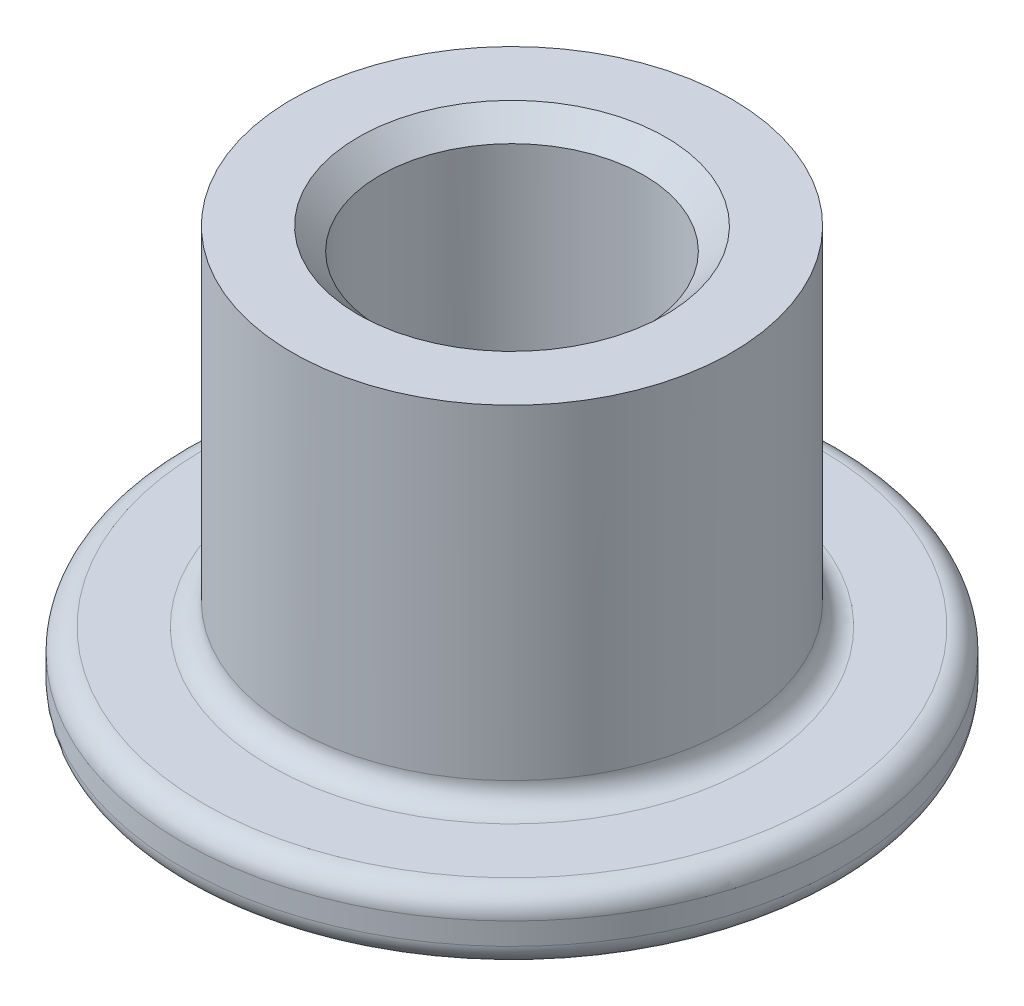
ISO-10303-21;
HEADER;
FILE_DESCRIPTION(('STEP AP214'),'2;1');
FILE_NAME('part.step','',(''),(''),'','','');
FILE_SCHEMA(('AUTOMOTIVE_DESIGN { 1 0 10303 214 1 1 1 1 }'));
ENDSEC;
DATA;
#1=APPLICATION_CONTEXT('core data for automotive mechanical design processes');
#2=APPLICATION_PROTOCOL_DEFINITION('international standard','automotive_design',2000,#1);
#3=PRODUCT_CONTEXT('',#1,'mechanical');
#4=PRODUCT('Part','Part','',(#3));
#5=PRODUCT_RELATED_PRODUCT_CATEGORY('part','',(#4));
#6=PRODUCT_DEFINITION_FORMATION('','',#4);
#7=PRODUCT_DEFINITION_CONTEXT('part definition',#1,'design');
#8=PRODUCT_DEFINITION('design','',#6,#7);
#9=PRODUCT_DEFINITION_SHAPE('','',#8);
#10=(LENGTH_UNIT() NAMED_UNIT(*) SI_UNIT(.MILLI.,.METRE.));
#11=(NAMED_UNIT(*) PLANE_ANGLE_UNIT() SI_UNIT($,.RADIAN.));
#12=(NAMED_UNIT(*) SI_UNIT($,.STERADIAN.) SOLID_ANGLE_UNIT());
#13=UNCERTAINTY_MEASURE_WITH_UNIT(LENGTH_MEASURE(1.E-05),#10,'distance_accuracy_value','');
#14=(GEOMETRIC_REPRESENTATION_CONTEXT(3) GLOBAL_UNCERTAINTY_ASSIGNED_CONTEXT((#13)) GLOBAL_UNIT_ASSIGNED_CONTEXT((#10,
#11,#12)) REPRESENTATION_CONTEXT('',''));
#15=CARTESIAN_POINT('',(0.,0.,0.));
#16=DIRECTION('',(0.,0.,1.));
#17=DIRECTION('',(1.,0.,0.));
#18=AXIS2_PLACEMENT_3D('',#15,#16,#17);
#19=CARTESIAN_POINT('',(0.,-18.2966101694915,0.));
#20=DIRECTION('',(0.,-1.,0.));
#21=DIRECTION('',(0.,0.,-1.));
#22=AXIS2_PLACEMENT_3D('',#19,#20,#21);
#23=CYLINDRICAL_SURFACE('',#22,3.);
#24=CARTESIAN_POINT('',(0.,0.5,0.));
#25=DIRECTION('',(0.,-1.,0.));
#26=DIRECTION('',(0.,0.,-1.));
#27=AXIS2_PLACEMENT_3D('',#24,#25,#26);
#28=CIRCLE('',#27,3.);
#29=CARTESIAN_POINT('',(0.,0.5,-3.));
#30=VERTEX_POINT('',#29);
#31=EDGE_CURVE('E61',#30,#30,#28,.T.);
#32=ORIENTED_EDGE('',*,*,#31,.T.);
#33=EDGE_LOOP('',(#32));
#34=FACE_BOUND('',#33,.T.);
#35=CARTESIAN_POINT('',(0.,8.9,0.));
#36=DIRECTION('',(0.,1.,0.));
#37=DIRECTION('',(0.,0.,1.));
#38=AXIS2_PLACEMENT_3D('',#35,#36,#37);
#39=CIRCLE('',#38,3.);
#40=CARTESIAN_POINT('',(0.,8.9,3.));
#41=VERTEX_POINT('',#40);
#42=EDGE_CURVE('E64',#41,#41,#39,.T.);
#43=ORIENTED_EDGE('',*,*,#42,.T.);
#44=EDGE_LOOP('',(#43));
#45=FACE_BOUND('',#44,.T.);
#46=ADVANCED_FACE('F29',(#34,#45),#23,.F.);
#47=CARTESIAN_POINT('',(3.,0.,0.));
#48=DIRECTION('',(0.,-1.,0.));
#49=DIRECTION('',(0.,0.,-1.));
#50=AXIS2_PLACEMENT_3D('',#47,#48,#49);
#51=PLANE('',#50);
#52=CARTESIAN_POINT('',(0.,0.,0.));
#53=DIRECTION('',(0.,-1.,0.));
#54=DIRECTION('',(0.,0.,-1.));
#55=AXIS2_PLACEMENT_3D('',#52,#53,#54);
#56=CIRCLE('',#55,7.);
#57=CARTESIAN_POINT('',(0.,0.,-7.));
#58=VERTEX_POINT('',#57);
#59=EDGE_CURVE('E40',#58,#58,#56,.T.);
#60=ORIENTED_EDGE('',*,*,#59,.T.);
#61=EDGE_LOOP('',(#60));
#62=FACE_BOUND('',#61,.T.);
#63=CARTESIAN_POINT('',(0.,0.,0.));
#64=DIRECTION('',(0.,-1.,0.));
#65=DIRECTION('',(0.,0.,-1.));
#66=AXIS2_PLACEMENT_3D('',#63,#64,#65);
#67=CIRCLE('',#66,3.5);
#68=CARTESIAN_POINT('',(0.,0.,-3.5));
#69=VERTEX_POINT('',#68);
#70=EDGE_CURVE('E58',#69,#69,#67,.F.);
#71=ORIENTED_EDGE('',*,*,#70,.T.);
#72=EDGE_LOOP('',(#71));
#73=FACE_BOUND('',#72,.T.);
#74=ADVANCED_FACE('F89',(#62,#73),#51,.T.);
#75=CARTESIAN_POINT('',(0.,-18.2966101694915,0.));
#76=DIRECTION('',(0.,-1.,0.));
#77=DIRECTION('',(0.,0.,-1.));
#78=AXIS2_PLACEMENT_3D('',#75,#76,#77);
#79=CYLINDRICAL_SURFACE('',#78,7.5);
#80=CARTESIAN_POINT('',(0.,0.5,0.));
#81=DIRECTION('',(0.,-1.,0.));
#82=DIRECTION('',(0.,0.,-1.));
#83=AXIS2_PLACEMENT_3D('',#80,#81,#82);
#84=CIRCLE('',#83,7.5);
#85=CARTESIAN_POINT('',(0.,0.5,-7.5));
#86=VERTEX_POINT('',#85);
#87=EDGE_CURVE('E10',#86,#86,#84,.F.);
#88=ORIENTED_EDGE('',*,*,#87,.T.);
#89=EDGE_LOOP('',(#88));
#90=FACE_BOUND('',#89,.T.);
#91=CARTESIAN_POINT('',(0.,1.,0.));
#92=DIRECTION('',(0.,1.,0.));
#93=DIRECTION('',(0.,0.,1.));
#94=AXIS2_PLACEMENT_3D('',#91,#92,#93);
#95=CIRCLE('',#94,7.5);
#96=CARTESIAN_POINT('',(0.,1.,7.5));
#97=VERTEX_POINT('',#96);
#98=EDGE_CURVE('E36',#97,#97,#95,.F.);
#99=ORIENTED_EDGE('',*,*,#98,.T.);
#100=EDGE_LOOP('',(#99));
#101=FACE_BOUND('',#100,.T.);
#102=ADVANCED_FACE('F95',(#90,#101),#79,.T.);
#103=CARTESIAN_POINT('',(7.5,1.5,0.));
#104=DIRECTION('',(0.,1.,0.));
#105=DIRECTION('',(0.,0.,1.));
#106=AXIS2_PLACEMENT_3D('',#103,#104,#105);
#107=PLANE('',#106);
#108=CARTESIAN_POINT('',(0.,1.5,0.));
#109=DIRECTION('',(0.,1.,0.));
#110=DIRECTION('',(0.,0.,1.));
#111=AXIS2_PLACEMENT_3D('',#108,#109,#110);
#112=CIRCLE('',#111,5.5);
#113=CARTESIAN_POINT('',(0.,1.5,5.5));
#114=VERTEX_POINT('',#113);
#115=EDGE_CURVE('E49',#114,#114,#112,.F.);
#116=ORIENTED_EDGE('',*,*,#115,.T.);
#117=EDGE_LOOP('',(#116));
#118=FACE_BOUND('',#117,.T.);
#119=CARTESIAN_POINT('',(0.,1.5,0.));
#120=DIRECTION('',(0.,1.,0.));
#121=DIRECTION('',(0.,0.,1.));
#122=AXIS2_PLACEMENT_3D('',#119,#120,#121);
#123=CIRCLE('',#122,7.);
#124=CARTESIAN_POINT('',(0.,1.5,7.));
#125=VERTEX_POINT('',#124);
#126=EDGE_CURVE('E52',#125,#125,#123,.T.);
#127=ORIENTED_EDGE('',*,*,#126,.T.);
#128=EDGE_LOOP('',(#127));
#129=FACE_BOUND('',#128,.T.);
#130=ADVANCED_FACE('F85',(#118,#129),#107,.T.);
#131=CARTESIAN_POINT('',(0.,-18.2966101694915,0.));
#132=DIRECTION('',(0.,-1.,0.));
#133=DIRECTION('',(0.,0.,-1.));
#134=AXIS2_PLACEMENT_3D('',#131,#132,#133);
#135=CYLINDRICAL_SURFACE('',#134,5.);
#136=CARTESIAN_POINT('',(0.,2.,0.));
#137=DIRECTION('',(0.,1.,0.));
#138=DIRECTION('',(0.,0.,1.));
#139=AXIS2_PLACEMENT_3D('',#136,#137,#138);
#140=CIRCLE('',#139,5.);
#141=CARTESIAN_POINT('',(0.,2.,5.));
#142=VERTEX_POINT('',#141);
#143=EDGE_CURVE('E44',#142,#142,#140,.T.);
#144=ORIENTED_EDGE('',*,*,#143,.T.);
#145=EDGE_LOOP('',(#144));
#146=FACE_BOUND('',#145,.T.);
#147=CARTESIAN_POINT('',(0.,9.4,0.));
#148=DIRECTION('',(0.,-1.,0.));
#149=DIRECTION('',(0.,0.,-1.));
#150=AXIS2_PLACEMENT_3D('',#147,#148,#149);
#151=CIRCLE('',#150,5.);
#152=CARTESIAN_POINT('',(0.,9.4,-5.));
#153=VERTEX_POINT('',#152);
#154=EDGE_CURVE('E67',#153,#153,#151,.T.);
#155=ORIENTED_EDGE('',*,*,#154,.T.);
#156=EDGE_LOOP('',(#155));
#157=FACE_BOUND('',#156,.T.);
#158=ADVANCED_FACE('F71',(#146,#157),#135,.T.);
#159=CARTESIAN_POINT('',(5.,9.4,0.));
#160=DIRECTION('',(0.,1.,0.));
#161=DIRECTION('',(0.,0.,1.));
#162=AXIS2_PLACEMENT_3D('',#159,#160,#161);
#163=PLANE('',#162);
#164=CARTESIAN_POINT('',(0.,9.4,0.));
#165=DIRECTION('',(0.,1.,0.));
#166=DIRECTION('',(0.,0.,1.));
#167=AXIS2_PLACEMENT_3D('',#164,#165,#166);
#168=CIRCLE('',#167,3.5);
#169=CARTESIAN_POINT('',(0.,9.4,3.5));
#170=VERTEX_POINT('',#169);
#171=EDGE_CURVE('E55',#170,#170,#168,.F.);
#172=ORIENTED_EDGE('',*,*,#171,.T.);
#173=EDGE_LOOP('',(#172));
#174=FACE_BOUND('',#173,.T.);
#175=ORIENTED_EDGE('',*,*,#154,.F.);
#176=EDGE_LOOP('',(#175));
#177=FACE_BOUND('',#176,.T.);
#178=ADVANCED_FACE('F73',(#174,#177),#163,.T.);
#179=CARTESIAN_POINT('',(0.,0.5,0.));
#180=DIRECTION('',(0.,-1.,0.));
#181=DIRECTION('',(0.,0.,-1.));
#182=AXIS2_PLACEMENT_3D('',#179,#180,#181);
#183=CONICAL_SURFACE('',#182,3.,0.78539816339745);
#184=ORIENTED_EDGE('',*,*,#70,.F.);
#185=EDGE_LOOP('',(#184));
#186=FACE_BOUND('',#185,.T.);
#187=ORIENTED_EDGE('',*,*,#31,.F.);
#188=EDGE_LOOP('',(#187));
#189=FACE_BOUND('',#188,.T.);
#190=ADVANCED_FACE('F75',(#186,#189),#183,.F.);
#191=CARTESIAN_POINT('',(0.,9.4,0.));
#192=DIRECTION('',(0.,1.,0.));
#193=DIRECTION('',(0.,0.,1.));
#194=AXIS2_PLACEMENT_3D('',#191,#192,#193);
#195=CONICAL_SURFACE('',#194,3.5,0.785398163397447);
#196=ORIENTED_EDGE('',*,*,#42,.F.);
#197=EDGE_LOOP('',(#196));
#198=FACE_BOUND('',#197,.T.);
#199=ORIENTED_EDGE('',*,*,#171,.F.);
#200=EDGE_LOOP('',(#199));
#201=FACE_BOUND('',#200,.T.);
#202=ADVANCED_FACE('F82',(#198,#201),#195,.F.);
#203=CARTESIAN_POINT('',(0.,2.,0.));
#204=DIRECTION('',(0.,1.,0.));
#205=DIRECTION('',(0.,0.,1.));
#206=AXIS2_PLACEMENT_3D('',#203,#204,#205);
#207=TOROIDAL_SURFACE('',#206,5.5,0.5);
#208=ORIENTED_EDGE('',*,*,#143,.F.);
#209=EDGE_LOOP('',(#208));
#210=FACE_BOUND('',#209,.T.);
#211=ORIENTED_EDGE('',*,*,#115,.F.);
#212=EDGE_LOOP('',(#211));
#213=FACE_BOUND('',#212,.T.);
#214=ADVANCED_FACE('F103',(#210,#213),#207,.F.);
#215=CARTESIAN_POINT('',(0.,0.5,0.));
#216=DIRECTION('',(0.,-1.,0.));
#217=DIRECTION('',(0.,0.,-1.));
#218=AXIS2_PLACEMENT_3D('',#215,#216,#217);
#219=TOROIDAL_SURFACE('',#218,7.,0.5);
#220=ORIENTED_EDGE('',*,*,#87,.F.);
#221=EDGE_LOOP('',(#220));
#222=FACE_BOUND('',#221,.T.);
#223=ORIENTED_EDGE('',*,*,#59,.F.);
#224=EDGE_LOOP('',(#223));
#225=FACE_BOUND('',#224,.T.);
#226=ADVANCED_FACE('F106',(#222,#225),#219,.T.);
#227=CARTESIAN_POINT('',(0.,1.,0.));
#228=DIRECTION('',(0.,1.,0.));
#229=DIRECTION('',(0.,0.,1.));
#230=AXIS2_PLACEMENT_3D('',#227,#228,#229);
#231=TOROIDAL_SURFACE('',#230,7.,0.5);
#232=ORIENTED_EDGE('',*,*,#126,.F.);
#233=EDGE_LOOP('',(#232));
#234=FACE_BOUND('',#233,.T.);
#235=ORIENTED_EDGE('',*,*,#98,.F.);
#236=EDGE_LOOP('',(#235));
#237=FACE_BOUND('',#236,.T.);
#238=ADVANCED_FACE('F31',(#234,#237),#231,.T.);
#239=CLOSED_SHELL('',(#46,#74,#102,#130,#158,#178,#190,#202,#214,#226,#238));
#240=MANIFOLD_SOLID_BREP('B2',#239);
#241=ADVANCED_BREP_SHAPE_REPRESENTATION('',(#18,#240),#14);
#242=SHAPE_DEFINITION_REPRESENTATION(#9,#241);
ENDSEC;
END-ISO-10303-21;
